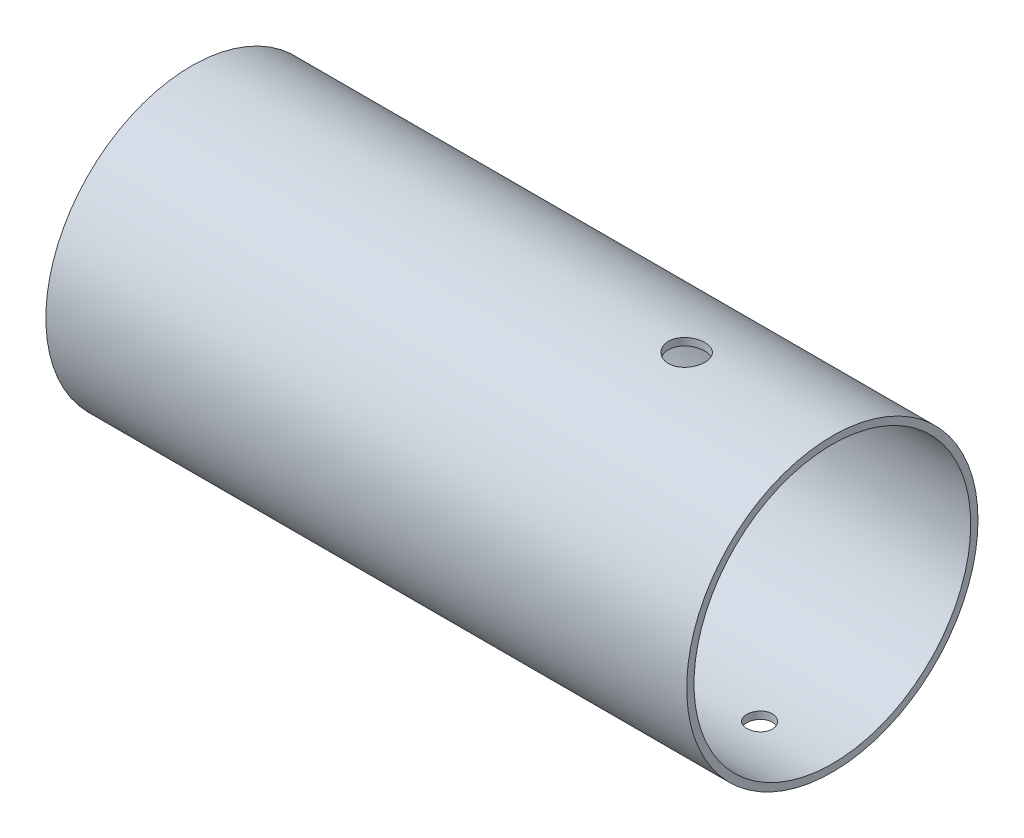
ISO-10303-21;
HEADER;
FILE_DESCRIPTION(('STEP AP214'),'2;1');
FILE_NAME('part.step','',(''),(''),'','','');
FILE_SCHEMA(('AUTOMOTIVE_DESIGN { 1 0 10303 214 1 1 1 1 }'));
ENDSEC;
DATA;
#1=APPLICATION_CONTEXT('core data for automotive mechanical design processes');
#2=APPLICATION_PROTOCOL_DEFINITION('international standard','automotive_design',2000,#1);
#3=PRODUCT_CONTEXT('',#1,'mechanical');
#4=PRODUCT('Part','Part','',(#3));
#5=PRODUCT_RELATED_PRODUCT_CATEGORY('part','',(#4));
#6=PRODUCT_DEFINITION_FORMATION('','',#4);
#7=PRODUCT_DEFINITION_CONTEXT('part definition',#1,'design');
#8=PRODUCT_DEFINITION('design','',#6,#7);
#9=PRODUCT_DEFINITION_SHAPE('','',#8);
#10=(LENGTH_UNIT() NAMED_UNIT(*) SI_UNIT(.MILLI.,.METRE.));
#11=(NAMED_UNIT(*) PLANE_ANGLE_UNIT() SI_UNIT($,.RADIAN.));
#12=(NAMED_UNIT(*) SI_UNIT($,.STERADIAN.) SOLID_ANGLE_UNIT());
#13=UNCERTAINTY_MEASURE_WITH_UNIT(LENGTH_MEASURE(1.E-05),#10,'distance_accuracy_value','');
#14=(GEOMETRIC_REPRESENTATION_CONTEXT(3) GLOBAL_UNCERTAINTY_ASSIGNED_CONTEXT((#13)) GLOBAL_UNIT_ASSIGNED_CONTEXT((#10,
#11,#12)) REPRESENTATION_CONTEXT('',''));
#15=CARTESIAN_POINT('',(0.,0.,0.));
#16=DIRECTION('',(0.,0.,1.));
#17=DIRECTION('',(1.,0.,0.));
#18=AXIS2_PLACEMENT_3D('',#15,#16,#17);
#19=CARTESIAN_POINT('',(88.,0.,0.));
#20=DIRECTION('',(-1.,0.,0.));
#21=DIRECTION('',(0.,0.,1.));
#22=AXIS2_PLACEMENT_3D('',#19,#20,#21);
#23=CYLINDRICAL_SURFACE('',#22,20.);
#24=CARTESIAN_POINT('',(0.,0.,0.));
#25=DIRECTION('',(1.,0.,0.));
#26=DIRECTION('',(0.,0.,-1.));
#27=AXIS2_PLACEMENT_3D('',#24,#25,#26);
#28=CIRCLE('',#27,20.);
#29=CARTESIAN_POINT('',(0.,0.,-20.));
#30=VERTEX_POINT('',#29);
#31=EDGE_CURVE('E40',#30,#30,#28,.T.);
#32=ORIENTED_EDGE('',*,*,#31,.T.);
#33=EDGE_LOOP('',(#32));
#34=FACE_BOUND('',#33,.T.);
#35=CARTESIAN_POINT('',(88.,0.,0.));
#36=DIRECTION('',(1.,0.,0.));
#37=DIRECTION('',(0.,0.,-1.));
#38=AXIS2_PLACEMENT_3D('',#35,#36,#37);
#39=CIRCLE('',#38,20.);
#40=CARTESIAN_POINT('',(88.,0.,-20.));
#41=VERTEX_POINT('',#40);
#42=EDGE_CURVE('E10',#41,#41,#39,.T.);
#43=ORIENTED_EDGE('',*,*,#42,.F.);
#44=EDGE_LOOP('',(#43));
#45=FACE_BOUND('',#44,.T.);
#46=CARTESIAN_POINT('',(10.,-19.9232903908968,1.75));
#47=CARTESIAN_POINT('',(10.0980961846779,-19.923291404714,1.7499957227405));
#48=CARTESIAN_POINT('',(10.1962587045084,-19.9240226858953,1.74172407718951));
#49=CARTESIAN_POINT('',(10.3898664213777,-19.9268686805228,1.7088494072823));
#50=CARTESIAN_POINT('',(10.4853084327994,-19.9289849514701,1.68422799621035));
#51=CARTESIAN_POINT('',(10.6706431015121,-19.9343594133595,1.61937247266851));
#52=CARTESIAN_POINT('',(10.7605389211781,-19.9376169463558,1.57914735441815));
#53=CARTESIAN_POINT('',(10.9322818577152,-19.9449060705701,1.48424256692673));
#54=CARTESIAN_POINT('',(11.0141306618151,-19.9489374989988,1.4295659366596));
#55=CARTESIAN_POINT('',(11.167707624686,-19.9573329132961,1.30714408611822));
#56=CARTESIAN_POINT('',(11.2394099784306,-19.9616977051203,1.23936654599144));
#57=CARTESIAN_POINT('',(11.3704368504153,-19.9702606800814,1.09273540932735));
#58=CARTESIAN_POINT('',(11.4297608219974,-19.9744588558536,1.01388132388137));
#59=CARTESIAN_POINT('',(11.5344337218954,-19.982223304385,0.847180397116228));
#60=CARTESIAN_POINT('',(11.5797601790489,-19.9857885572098,0.759319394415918));
#61=CARTESIAN_POINT('',(11.6550076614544,-19.9918767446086,0.577197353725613));
#62=CARTESIAN_POINT('',(11.684928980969,-19.9943996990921,0.482936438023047));
#63=CARTESIAN_POINT('',(11.7284421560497,-19.99811338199,0.290948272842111));
#64=CARTESIAN_POINT('',(11.7420759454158,-19.9993075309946,0.193230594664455));
#65=CARTESIAN_POINT('',(11.7527567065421,-20.00024065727,-0.0031129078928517));
#66=CARTESIAN_POINT('',(11.7498040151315,-19.9999796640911,-0.10173871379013));
#67=CARTESIAN_POINT('',(11.7274298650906,-19.9980347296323,-0.296814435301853));
#68=CARTESIAN_POINT('',(11.7080534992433,-19.9963546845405,-0.393269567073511));
#69=CARTESIAN_POINT('',(11.6534521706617,-19.9917650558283,-0.58155330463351));
#70=CARTESIAN_POINT('',(11.6182270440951,-19.9888554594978,-0.67338186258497));
#71=CARTESIAN_POINT('',(11.5328780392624,-19.9821273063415,-0.849948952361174));
#72=CARTESIAN_POINT('',(11.4827340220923,-19.9783075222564,-0.934677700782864));
#73=CARTESIAN_POINT('',(11.3689852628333,-19.9701881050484,-1.09453325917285));
#74=CARTESIAN_POINT('',(11.3053802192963,-19.9658884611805,-1.16965985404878));
#75=CARTESIAN_POINT('',(11.1662609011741,-19.9572753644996,-1.30844229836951));
#76=CARTESIAN_POINT('',(11.0907074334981,-19.9529619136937,-1.37205886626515));
#77=CARTESIAN_POINT('',(10.9299723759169,-19.9448218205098,-1.48571178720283));
#78=CARTESIAN_POINT('',(10.8447907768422,-19.9409951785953,-1.53574812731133));
#79=CARTESIAN_POINT('',(10.6671892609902,-19.9342613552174,-1.62081905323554));
#80=CARTESIAN_POINT('',(10.5747683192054,-19.9313543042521,-1.65585151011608));
#81=CARTESIAN_POINT('',(10.3853251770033,-19.9267914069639,-1.70989067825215));
#82=CARTESIAN_POINT('',(10.2883030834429,-19.9251355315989,-1.72889776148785));
#83=CARTESIAN_POINT('',(10.0927557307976,-19.9232672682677,-1.75029672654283));
#84=CARTESIAN_POINT('',(9.99423651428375,-19.9230501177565,-1.7527434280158));
#85=CARTESIAN_POINT('',(9.79818936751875,-19.9240713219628,-1.74109586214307));
#86=CARTESIAN_POINT('',(9.70066142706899,-19.9253096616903,-1.7270017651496));
#87=CARTESIAN_POINT('',(9.50952323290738,-19.9290979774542,-1.68271842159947));
#88=CARTESIAN_POINT('',(9.41590698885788,-19.9316458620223,-1.65255483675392));
#89=CARTESIAN_POINT('',(9.23506389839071,-19.9377644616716,-1.57701486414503));
#90=CARTESIAN_POINT('',(9.14783716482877,-19.9413351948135,-1.53163820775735));
#91=CARTESIAN_POINT('',(8.98199851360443,-19.9491087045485,-1.42682177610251));
#92=CARTESIAN_POINT('',(8.90340973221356,-19.9533131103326,-1.36734551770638));
#93=CARTESIAN_POINT('',(8.75731184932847,-19.961874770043,-1.23607079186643));
#94=CARTESIAN_POINT('',(8.6898029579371,-19.9662320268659,-1.16427209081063));
#95=CARTESIAN_POINT('',(8.56759361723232,-19.9746226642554,-1.01015347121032));
#96=CARTESIAN_POINT('',(8.51292881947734,-19.9786551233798,-0.927805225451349));
#97=CARTESIAN_POINT('',(8.41820418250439,-19.985928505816,-0.755065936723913));
#98=CARTESIAN_POINT('',(8.37814418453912,-19.9891694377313,-0.664674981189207));
#99=CARTESIAN_POINT('',(8.31382733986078,-19.9944903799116,-0.478543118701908));
#100=CARTESIAN_POINT('',(8.28954856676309,-19.9965720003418,-0.382809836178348));
#101=CARTESIAN_POINT('',(8.2574117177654,-19.9993463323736,-0.188606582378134));
#102=CARTESIAN_POINT('',(8.24955329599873,-20.0000390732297,-0.0901366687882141));
#103=CARTESIAN_POINT('',(8.25048444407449,-19.9999576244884,0.106393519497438));
#104=CARTESIAN_POINT('',(8.25921850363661,-19.9991883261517,0.204454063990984));
#105=CARTESIAN_POINT('',(8.29297077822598,-19.9962789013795,0.397709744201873));
#106=CARTESIAN_POINT('',(8.31798901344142,-19.9941387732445,0.492904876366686));
#107=CARTESIAN_POINT('',(8.3835850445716,-19.9887277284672,0.677730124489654));
#108=CARTESIAN_POINT('',(8.42416169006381,-19.9854568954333,0.767360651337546));
#109=CARTESIAN_POINT('',(8.51971649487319,-19.978150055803,0.938546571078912));
#110=CARTESIAN_POINT('',(8.57469446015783,-19.9741140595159,1.02010207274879));
#111=CARTESIAN_POINT('',(8.69769973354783,-19.9657135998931,1.17310714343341));
#112=CARTESIAN_POINT('',(8.76576820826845,-19.9613481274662,1.24452356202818));
#113=CARTESIAN_POINT('',(8.91294581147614,-19.9527893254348,1.37494802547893));
#114=CARTESIAN_POINT('',(8.99205760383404,-19.9485960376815,1.4339530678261));
#115=CARTESIAN_POINT('',(9.15924495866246,-19.940847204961,1.5379685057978));
#116=CARTESIAN_POINT('',(9.24733836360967,-19.9372929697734,1.58295029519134));
#117=CARTESIAN_POINT('',(9.42979951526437,-19.9312405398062,1.65742558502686));
#118=CARTESIAN_POINT('',(9.52415993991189,-19.9287411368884,1.68693681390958));
#119=CARTESIAN_POINT('',(9.68255997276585,-19.9257212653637,1.72215354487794));
#120=CARTESIAN_POINT('',(9.74558217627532,-19.9248139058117,1.7325819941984));
#121=CARTESIAN_POINT('',(9.87239356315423,-19.9235981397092,1.74650660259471));
#122=CARTESIAN_POINT('',(9.9361827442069,-19.9232897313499,1.7500027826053));
#123=CARTESIAN_POINT('',(10.,-19.9232903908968,1.75));
#124=B_SPLINE_CURVE_WITH_KNOTS('',3,(#46,#47,#48,#49,#50,#51,#52,#53,#54,#55,#56,#57,#58,#59,
#60,#61,#62,#63,#64,#65,#66,#67,#68,#69,#70,#71,#72,#73,#74,#75,#76,#77,#78,#79,#80,#81,#82,#83,
#84,#85,#86,#87,#88,#89,#90,#91,#92,#93,#94,#95,#96,#97,#98,#99,#100,#101,#102,#103,#104,#105,
#106,#107,#108,#109,#110,#111,#112,#113,#114,#115,#116,#117,#118,#119,#120,#121,#122,#123),
.UNSPECIFIED.,.T.,.F.,(4,2,2,2,2,2,2,2,2,2,2,2,2,2,2,2,2,2,2,2,2,2,2,2,2,2,2,2,2,2,2,2,2,2,2,2,
2,2,4),(0.,0.29405553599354,0.588442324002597,0.882659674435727,1.17681520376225,
1.4717058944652,1.76660960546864,2.06198431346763,2.35735337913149,2.65196033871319,
2.94656131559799,3.24035604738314,3.53415381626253,3.82834999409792,4.12255276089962,
4.41774138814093,4.71293029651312,5.00816107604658,5.30338500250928,5.59763117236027,
5.89187431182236,6.18564897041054,6.47942881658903,6.77397728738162,7.06853134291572,
7.36389358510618,7.65925261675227,7.95420039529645,8.24914196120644,8.54309853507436,
8.83705547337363,9.13099068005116,9.42492192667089,9.7197930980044,10.0147355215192,
10.3102757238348,10.6054765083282,10.7967772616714,10.9880774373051),.UNSPECIFIED.);
#125=CARTESIAN_POINT('',(10.,-19.9232903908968,1.75));
#126=VERTEX_POINT('',#125);
#127=EDGE_CURVE('E54',#126,#126,#124,.T.);
#128=ORIENTED_EDGE('',*,*,#127,.T.);
#129=EDGE_LOOP('',(#128));
#130=FACE_BOUND('',#129,.T.);
#131=CARTESIAN_POINT('',(78.,-19.9232903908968,1.75));
#132=CARTESIAN_POINT('',(78.0980961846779,-19.923291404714,1.7499957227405));
#133=CARTESIAN_POINT('',(78.1962587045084,-19.9240226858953,1.7417240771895));
#134=CARTESIAN_POINT('',(78.3898664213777,-19.9268686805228,1.70884940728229));
#135=CARTESIAN_POINT('',(78.4853084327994,-19.9289849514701,1.68422799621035));
#136=CARTESIAN_POINT('',(78.6706431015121,-19.9343594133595,1.61937247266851));
#137=CARTESIAN_POINT('',(78.7605389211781,-19.9376169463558,1.57914735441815));
#138=CARTESIAN_POINT('',(78.9322818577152,-19.9449060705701,1.48424256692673));
#139=CARTESIAN_POINT('',(79.0141306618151,-19.9489374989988,1.42956593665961));
#140=CARTESIAN_POINT('',(79.167707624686,-19.9573329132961,1.30714408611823));
#141=CARTESIAN_POINT('',(79.2394099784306,-19.9616977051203,1.23936654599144));
#142=CARTESIAN_POINT('',(79.3704368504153,-19.9702606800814,1.09273540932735));
#143=CARTESIAN_POINT('',(79.4297608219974,-19.9744588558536,1.01388132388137));
#144=CARTESIAN_POINT('',(79.5344337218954,-19.982223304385,0.847180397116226));
#145=CARTESIAN_POINT('',(79.5797601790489,-19.9857885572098,0.759319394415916));
#146=CARTESIAN_POINT('',(79.6550076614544,-19.9918767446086,0.577197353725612));
#147=CARTESIAN_POINT('',(79.684928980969,-19.9943996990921,0.482936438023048));
#148=CARTESIAN_POINT('',(79.7284421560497,-19.99811338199,0.290948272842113));
#149=CARTESIAN_POINT('',(79.7420759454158,-19.9993075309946,0.193230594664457));
#150=CARTESIAN_POINT('',(79.7527567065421,-20.00024065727,-0.00311290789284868));
#151=CARTESIAN_POINT('',(79.7498040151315,-19.9999796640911,-0.101738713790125));
#152=CARTESIAN_POINT('',(79.7274298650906,-19.9980347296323,-0.296814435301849));
#153=CARTESIAN_POINT('',(79.7080534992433,-19.9963546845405,-0.393269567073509));
#154=CARTESIAN_POINT('',(79.6534521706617,-19.9917650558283,-0.581553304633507));
#155=CARTESIAN_POINT('',(79.6182270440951,-19.9888554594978,-0.673381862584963));
#156=CARTESIAN_POINT('',(79.5328780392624,-19.9821273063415,-0.849948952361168));
#157=CARTESIAN_POINT('',(79.4827340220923,-19.9783075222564,-0.93467770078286));
#158=CARTESIAN_POINT('',(79.3689852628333,-19.9701881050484,-1.09453325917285));
#159=CARTESIAN_POINT('',(79.3053802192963,-19.9658884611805,-1.16965985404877));
#160=CARTESIAN_POINT('',(79.1662609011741,-19.9572753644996,-1.30844229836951));
#161=CARTESIAN_POINT('',(79.0907074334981,-19.9529619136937,-1.37205886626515));
#162=CARTESIAN_POINT('',(78.9299723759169,-19.9448218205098,-1.48571178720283));
#163=CARTESIAN_POINT('',(78.8447907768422,-19.9409951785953,-1.53574812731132));
#164=CARTESIAN_POINT('',(78.6671892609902,-19.9342613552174,-1.62081905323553));
#165=CARTESIAN_POINT('',(78.5747683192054,-19.9313543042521,-1.65585151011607));
#166=CARTESIAN_POINT('',(78.3853251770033,-19.9267914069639,-1.70989067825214));
#167=CARTESIAN_POINT('',(78.2883030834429,-19.9251355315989,-1.72889776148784));
#168=CARTESIAN_POINT('',(78.0927557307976,-19.9232672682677,-1.75029672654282));
#169=CARTESIAN_POINT('',(77.9942365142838,-19.9230501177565,-1.75274342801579));
#170=CARTESIAN_POINT('',(77.7981893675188,-19.9240713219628,-1.74109586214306));
#171=CARTESIAN_POINT('',(77.700661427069,-19.9253096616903,-1.7270017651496));
#172=CARTESIAN_POINT('',(77.5095232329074,-19.9290979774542,-1.68271842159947));
#173=CARTESIAN_POINT('',(77.4159069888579,-19.9316458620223,-1.65255483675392));
#174=CARTESIAN_POINT('',(77.2350638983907,-19.9377644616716,-1.57701486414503));
#175=CARTESIAN_POINT('',(77.1478371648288,-19.9413351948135,-1.53163820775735));
#176=CARTESIAN_POINT('',(76.9819985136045,-19.9491087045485,-1.42682177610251));
#177=CARTESIAN_POINT('',(76.9034097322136,-19.9533131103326,-1.36734551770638));
#178=CARTESIAN_POINT('',(76.7573118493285,-19.961874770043,-1.23607079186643));
#179=CARTESIAN_POINT('',(76.6898029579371,-19.9662320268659,-1.16427209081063));
#180=CARTESIAN_POINT('',(76.5675936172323,-19.9746226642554,-1.01015347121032));
#181=CARTESIAN_POINT('',(76.5129288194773,-19.9786551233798,-0.927805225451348));
#182=CARTESIAN_POINT('',(76.4182041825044,-19.985928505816,-0.755065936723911));
#183=CARTESIAN_POINT('',(76.3781441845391,-19.9891694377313,-0.664674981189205));
#184=CARTESIAN_POINT('',(76.3138273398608,-19.9944903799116,-0.478543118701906));
#185=CARTESIAN_POINT('',(76.2895485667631,-19.9965720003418,-0.382809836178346));
#186=CARTESIAN_POINT('',(76.2574117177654,-19.9993463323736,-0.188606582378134));
#187=CARTESIAN_POINT('',(76.2495532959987,-20.0000390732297,-0.090136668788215));
#188=CARTESIAN_POINT('',(76.2504844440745,-19.9999576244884,0.106393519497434));
#189=CARTESIAN_POINT('',(76.2592185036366,-19.9991883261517,0.20445406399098));
#190=CARTESIAN_POINT('',(76.292970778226,-19.9962789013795,0.397709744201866));
#191=CARTESIAN_POINT('',(76.3179890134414,-19.9941387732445,0.49290487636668));
#192=CARTESIAN_POINT('',(76.3835850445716,-19.9887277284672,0.677730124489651));
#193=CARTESIAN_POINT('',(76.4241616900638,-19.9854568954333,0.767360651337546));
#194=CARTESIAN_POINT('',(76.5197164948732,-19.978150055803,0.938546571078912));
#195=CARTESIAN_POINT('',(76.5746944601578,-19.9741140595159,1.02010207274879));
#196=CARTESIAN_POINT('',(76.6976997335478,-19.9657135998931,1.1731071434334));
#197=CARTESIAN_POINT('',(76.7657682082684,-19.9613481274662,1.24452356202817));
#198=CARTESIAN_POINT('',(76.9129458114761,-19.9527893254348,1.37494802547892));
#199=CARTESIAN_POINT('',(76.992057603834,-19.9485960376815,1.43395306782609));
#200=CARTESIAN_POINT('',(77.1592449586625,-19.940847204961,1.5379685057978));
#201=CARTESIAN_POINT('',(77.2473383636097,-19.9372929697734,1.58295029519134));
#202=CARTESIAN_POINT('',(77.4297995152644,-19.9312405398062,1.65742558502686));
#203=CARTESIAN_POINT('',(77.5241599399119,-19.9287411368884,1.68693681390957));
#204=CARTESIAN_POINT('',(77.6825599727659,-19.9257212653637,1.72215354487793));
#205=CARTESIAN_POINT('',(77.7455821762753,-19.9248139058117,1.73258199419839));
#206=CARTESIAN_POINT('',(77.8723935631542,-19.9235981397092,1.7465066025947));
#207=CARTESIAN_POINT('',(77.9361827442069,-19.9232897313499,1.7500027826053));
#208=CARTESIAN_POINT('',(78.,-19.9232903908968,1.75));
#209=B_SPLINE_CURVE_WITH_KNOTS('',3,(#131,#132,#133,#134,#135,#136,#137,#138,#139,#140,#141,
#142,#143,#144,#145,#146,#147,#148,#149,#150,#151,#152,#153,#154,#155,#156,#157,#158,#159,#160,
#161,#162,#163,#164,#165,#166,#167,#168,#169,#170,#171,#172,#173,#174,#175,#176,#177,#178,#179,
#180,#181,#182,#183,#184,#185,#186,#187,#188,#189,#190,#191,#192,#193,#194,#195,#196,#197,#198,
#199,#200,#201,#202,#203,#204,#205,#206,#207,#208),.UNSPECIFIED.,.T.,.F.,(4,2,2,2,2,2,2,2,2,2,2,
2,2,2,2,2,2,2,2,2,2,2,2,2,2,2,2,2,2,2,2,2,2,2,2,2,2,2,4),(0.,0.29405553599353,0.588442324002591,
0.882659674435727,1.17681520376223,1.47170589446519,1.76660960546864,2.06198431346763,
2.35735337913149,2.65196033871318,2.94656131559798,3.24035604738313,3.53415381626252,
3.82834999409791,4.12255276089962,4.41774138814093,4.7129302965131,5.00816107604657,
5.30338500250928,5.59763117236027,5.89187431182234,6.18564897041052,6.47942881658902,
6.7739772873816,7.06853134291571,7.36389358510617,7.65925261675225,7.95420039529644,
8.24914196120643,8.54309853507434,8.83705547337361,9.13099068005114,9.42492192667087,
9.71979309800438,10.0147355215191,10.3102757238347,10.6054765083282,10.7967772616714,
10.988077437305),.UNSPECIFIED.);
#210=CARTESIAN_POINT('',(78.,-19.9232903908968,1.75));
#211=VERTEX_POINT('',#210);
#212=EDGE_CURVE('E55',#211,#211,#209,.T.);
#213=ORIENTED_EDGE('',*,*,#212,.T.);
#214=EDGE_LOOP('',(#213));
#215=FACE_BOUND('',#214,.T.);
#216=CARTESIAN_POINT('',(68.,19.8431348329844,-2.5));
#217=CARTESIAN_POINT('',(67.8601637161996,19.8431368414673,-2.49999405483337));
#218=CARTESIAN_POINT('',(67.7202400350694,19.8446289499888,-2.48822789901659));
#219=CARTESIAN_POINT('',(67.4442867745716,19.8504339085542,-2.44147641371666));
#220=CARTESIAN_POINT('',(67.3082614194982,19.8547497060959,-2.4064668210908));
#221=CARTESIAN_POINT('',(67.0441401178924,19.8657057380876,-2.31427669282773));
#222=CARTESIAN_POINT('',(66.9160388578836,19.8723443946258,-2.25711120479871));
#223=CARTESIAN_POINT('',(66.6712715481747,19.8871962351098,-2.12226419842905));
#224=CARTESIAN_POINT('',(66.5546035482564,19.8954091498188,-2.04458618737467));
#225=CARTESIAN_POINT('',(66.3353377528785,19.9125355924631,-1.87045345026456));
#226=CARTESIAN_POINT('',(66.2328131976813,19.9214524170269,-1.77390681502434));
#227=CARTESIAN_POINT('',(66.0453772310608,19.9389523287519,-1.5649752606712));
#228=CARTESIAN_POINT('',(65.9604666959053,19.9475353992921,-1.45258955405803));
#229=CARTESIAN_POINT('',(65.8104064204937,19.96343444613,-1.21470983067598));
#230=CARTESIAN_POINT('',(65.7453229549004,19.9707461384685,-1.08917369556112));
#231=CARTESIAN_POINT('',(65.637188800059,19.9832423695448,-0.828846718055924));
#232=CARTESIAN_POINT('',(65.5941372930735,19.9884269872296,-0.694056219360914));
#233=CARTESIAN_POINT('',(65.5315079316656,19.9960616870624,-0.419795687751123));
#234=CARTESIAN_POINT('',(65.5118083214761,19.9985259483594,-0.280353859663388));
#235=CARTESIAN_POINT('',(65.4960646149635,20.0004906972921,-0.000123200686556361));
#236=CARTESIAN_POINT('',(65.5000195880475,19.9999913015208,0.140665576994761));
#237=CARTESIAN_POINT('',(65.5313752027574,19.9960964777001,0.418765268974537));
#238=CARTESIAN_POINT('',(65.5586448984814,19.9927172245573,0.556091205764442));
#239=CARTESIAN_POINT('',(65.6356511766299,19.9834605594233,0.824202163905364));
#240=CARTESIAN_POINT('',(65.6853881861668,19.9775830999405,0.954987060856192));
#241=CARTESIAN_POINT('',(65.8060564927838,19.9639625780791,1.20670881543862));
#242=CARTESIAN_POINT('',(65.8770444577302,19.9562145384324,1.3276182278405));
#243=CARTESIAN_POINT('',(66.038158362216,19.9397196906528,1.55585745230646));
#244=CARTESIAN_POINT('',(66.1282851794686,19.9309728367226,1.66318664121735));
#245=CARTESIAN_POINT('',(66.3258518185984,19.9133886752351,1.86198803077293));
#246=CARTESIAN_POINT('',(66.4334057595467,19.9045511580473,1.95334683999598));
#247=CARTESIAN_POINT('',(66.6623815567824,19.8878407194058,2.11673285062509));
#248=CARTESIAN_POINT('',(66.7838034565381,19.8799678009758,2.18875999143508));
#249=CARTESIAN_POINT('',(67.0371694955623,19.8660780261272,2.31144457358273));
#250=CARTESIAN_POINT('',(67.1691180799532,19.8600619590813,2.36209292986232));
#251=CARTESIAN_POINT('',(67.4397394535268,19.8505824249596,2.44048165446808));
#252=CARTESIAN_POINT('',(67.5784119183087,19.847118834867,2.46822312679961));
#253=CARTESIAN_POINT('',(67.8575431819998,19.8431588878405,2.49986043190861));
#254=CARTESIAN_POINT('',(67.9979836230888,19.8426426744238,2.50391584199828));
#255=CARTESIAN_POINT('',(68.2775419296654,19.8445834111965,2.48848695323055));
#256=CARTESIAN_POINT('',(68.4166598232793,19.8470402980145,2.4690031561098));
#257=CARTESIAN_POINT('',(68.6891457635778,19.8546322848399,2.40718328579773));
#258=CARTESIAN_POINT('',(68.8225316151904,19.8597583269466,2.36492448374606));
#259=CARTESIAN_POINT('',(69.0803241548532,19.8721036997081,2.25883371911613));
#260=CARTESIAN_POINT('',(69.2047305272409,19.8793231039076,2.19500099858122));
#261=CARTESIAN_POINT('',(69.441754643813,19.8950893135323,2.04718202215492));
#262=CARTESIAN_POINT('',(69.5543066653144,19.9036429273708,1.9630911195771));
#263=CARTESIAN_POINT('',(69.763756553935,19.9210923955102,1.77729074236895));
#264=CARTESIAN_POINT('',(69.860653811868,19.9299882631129,1.67558058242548));
#265=CARTESIAN_POINT('',(70.0366041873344,19.9471808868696,1.45673177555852));
#266=CARTESIAN_POINT('',(70.115552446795,19.9554739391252,1.33950849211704));
#267=CARTESIAN_POINT('',(70.2526382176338,19.9704711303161,1.09337258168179));
#268=CARTESIAN_POINT('',(70.310776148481,19.9771753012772,0.964460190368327));
#269=CARTESIAN_POINT('',(70.404417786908,19.9882229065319,0.698953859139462));
#270=CARTESIAN_POINT('',(70.4399820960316,19.992572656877,0.562381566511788));
#271=CARTESIAN_POINT('',(70.4876640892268,19.9984475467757,0.285146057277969));
#272=CARTESIAN_POINT('',(70.4997828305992,19.9999728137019,0.144483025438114));
#273=CARTESIAN_POINT('',(70.5002099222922,20.0000262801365,-0.135917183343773));
#274=CARTESIAN_POINT('',(70.488679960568,19.998574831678,-0.275654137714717));
#275=CARTESIAN_POINT('',(70.4424793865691,19.9928784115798,-0.551187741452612));
#276=CARTESIAN_POINT('',(70.4078087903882,19.9886334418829,-0.686984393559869));
#277=CARTESIAN_POINT('',(70.3163618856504,19.9778248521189,-0.950761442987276));
#278=CARTESIAN_POINT('',(70.259593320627,19.9712620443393,-1.07874456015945));
#279=CARTESIAN_POINT('',(70.1255786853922,19.9565444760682,-1.32339333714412));
#280=CARTESIAN_POINT('',(70.0483323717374,19.9483896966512,-1.44005886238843));
#281=CARTESIAN_POINT('',(69.8749567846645,19.9313319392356,-1.65958676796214));
#282=CARTESIAN_POINT('',(69.7787072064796,19.9224244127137,-1.76235378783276));
#283=CARTESIAN_POINT('',(69.5703070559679,19.9049015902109,-1.95034111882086));
#284=CARTESIAN_POINT('',(69.4581527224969,19.8962863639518,-2.03555726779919));
#285=CARTESIAN_POINT('',(69.220630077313,19.8802881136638,-2.18630524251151));
#286=CARTESIAN_POINT('',(69.0952124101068,19.8729099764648,-2.2517597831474));
#287=CARTESIAN_POINT('',(68.8351432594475,19.8602785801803,-2.36058528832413));
#288=CARTESIAN_POINT('',(68.7005020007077,19.8550230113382,-2.40398027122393));
#289=CARTESIAN_POINT('',(68.4709700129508,19.8485078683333,-2.4570658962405));
#290=CARTESIAN_POINT('',(68.3775270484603,19.8465030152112,-2.47314303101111));
#291=CARTESIAN_POINT('',(68.1894027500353,19.8438158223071,-2.49461205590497));
#292=CARTESIAN_POINT('',(68.0947214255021,19.8431334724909,-2.5000040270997));
#293=CARTESIAN_POINT('',(68.,19.8431348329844,-2.5));
#294=B_SPLINE_CURVE_WITH_KNOTS('',3,(#216,#217,#218,#219,#220,#221,#222,#223,#224,#225,#226,
#227,#228,#229,#230,#231,#232,#233,#234,#235,#236,#237,#238,#239,#240,#241,#242,#243,#244,#245,
#246,#247,#248,#249,#250,#251,#252,#253,#254,#255,#256,#257,#258,#259,#260,#261,#262,#263,#264,
#265,#266,#267,#268,#269,#270,#271,#272,#273,#274,#275,#276,#277,#278,#279,#280,#281,#282,#283,
#284,#285,#286,#287,#288,#289,#290,#291,#292,#293),.UNSPECIFIED.,.T.,.F.,(4,2,2,2,2,2,2,2,2,2,2,
2,2,2,2,2,2,2,2,2,2,2,2,2,2,2,2,2,2,2,2,2,2,2,2,2,2,2,4),(0.,0.419162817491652,
0.838763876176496,1.25808045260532,1.67732537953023,2.09866577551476,2.52002712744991,
2.94278186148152,3.36552090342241,3.78604596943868,4.20655449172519,4.62471664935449,
5.042886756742,5.46218204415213,5.88149656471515,6.3036769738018,6.72585870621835,
7.14821966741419,7.57056027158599,7.99005217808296,8.40953514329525,8.82760376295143,
9.24568707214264,9.66597819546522,10.0862856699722,10.5089888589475,10.9316835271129,
11.3532385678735,11.7747745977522,12.1934381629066,12.612101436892,13.030618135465,
13.4491398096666,13.8704012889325,14.2917625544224,14.7147509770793,15.1372778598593,
15.4212098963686,15.7051397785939),.UNSPECIFIED.);
#295=CARTESIAN_POINT('',(68.,19.8431348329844,-2.5));
#296=VERTEX_POINT('',#295);
#297=EDGE_CURVE('E109',#296,#296,#294,.T.);
#298=ORIENTED_EDGE('',*,*,#297,.F.);
#299=EDGE_LOOP('',(#298));
#300=FACE_BOUND('',#299,.T.);
#301=ADVANCED_FACE('F28',(#34,#45,#130,#215,#300),#23,.T.);
#302=CARTESIAN_POINT('',(88.,0.,0.));
#303=DIRECTION('',(-1.,0.,0.));
#304=DIRECTION('',(0.,0.,1.));
#305=AXIS2_PLACEMENT_3D('',#302,#303,#304);
#306=CYLINDRICAL_SURFACE('',#305,19.);
#307=CARTESIAN_POINT('',(0.,0.,0.));
#308=DIRECTION('',(1.,0.,0.));
#309=DIRECTION('',(0.,0.,-1.));
#310=AXIS2_PLACEMENT_3D('',#307,#308,#309);
#311=CIRCLE('',#310,19.);
#312=CARTESIAN_POINT('',(0.,0.,-19.));
#313=VERTEX_POINT('',#312);
#314=EDGE_CURVE('E77',#313,#313,#311,.T.);
#315=ORIENTED_EDGE('',*,*,#314,.F.);
#316=EDGE_LOOP('',(#315));
#317=FACE_BOUND('',#316,.T.);
#318=CARTESIAN_POINT('',(88.,0.,0.));
#319=DIRECTION('',(1.,0.,0.));
#320=DIRECTION('',(0.,0.,-1.));
#321=AXIS2_PLACEMENT_3D('',#318,#319,#320);
#322=CIRCLE('',#321,19.);
#323=CARTESIAN_POINT('',(88.,0.,-19.));
#324=VERTEX_POINT('',#323);
#325=EDGE_CURVE('E45',#324,#324,#322,.T.);
#326=ORIENTED_EDGE('',*,*,#325,.T.);
#327=EDGE_LOOP('',(#326));
#328=FACE_BOUND('',#327,.T.);
#329=CARTESIAN_POINT('',(10.,-18.9192362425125,1.75));
#330=CARTESIAN_POINT('',(10.0980743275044,-18.9192373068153,1.749995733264));
#331=CARTESIAN_POINT('',(10.1962144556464,-18.920007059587,1.74172775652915));
#332=CARTESIAN_POINT('',(10.3897765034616,-18.9230026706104,1.70886851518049));
#333=CARTESIAN_POINT('',(10.4851952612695,-18.925230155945,1.68425901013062));
#334=CARTESIAN_POINT('',(10.6704832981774,-18.9308868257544,1.61943696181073));
#335=CARTESIAN_POINT('',(10.7603557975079,-18.9343153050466,1.57923357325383));
#336=CARTESIAN_POINT('',(10.9320566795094,-18.9419867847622,1.48438193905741));
#337=CARTESIAN_POINT('',(11.0138867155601,-18.946229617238,1.42973667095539));
#338=CARTESIAN_POINT('',(11.1674543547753,-18.9550665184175,1.30736968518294));
#339=CARTESIAN_POINT('',(11.2391634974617,-18.9596615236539,1.23961231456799));
#340=CARTESIAN_POINT('',(11.3702089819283,-18.9686764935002,1.09302037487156));
#341=CARTESIAN_POINT('',(11.4295447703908,-18.973096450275,1.01418531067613));
#342=CARTESIAN_POINT('',(11.5342559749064,-18.9812723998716,0.847503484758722));
#343=CARTESIAN_POINT('',(11.5796064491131,-18.9850272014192,0.759640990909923));
#344=CARTESIAN_POINT('',(11.6549001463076,-18.9914396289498,0.577507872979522));
#345=CARTESIAN_POINT('',(11.684843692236,-18.9940972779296,0.48323738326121));
#346=CARTESIAN_POINT('',(11.7283907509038,-18.9980093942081,0.291250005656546));
#347=CARTESIAN_POINT('',(11.7420407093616,-18.9992678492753,0.193543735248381));
#348=CARTESIAN_POINT('',(11.7527567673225,-19.0002533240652,-0.00278053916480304));
#349=CARTESIAN_POINT('',(11.7498232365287,-18.9999803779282,-0.101398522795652));
#350=CARTESIAN_POINT('',(11.7274934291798,-18.9979370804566,-0.296431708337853));
#351=CARTESIAN_POINT('',(11.7081470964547,-18.996171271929,-0.392852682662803));
#352=CARTESIAN_POINT('',(11.6536185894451,-18.9913460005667,-0.581073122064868));
#353=CARTESIAN_POINT('',(11.6184362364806,-18.9882865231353,-0.67287253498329));
#354=CARTESIAN_POINT('',(11.5331791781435,-18.9812101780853,-0.849402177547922));
#355=CARTESIAN_POINT('',(11.4830822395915,-18.9771918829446,-0.934121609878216));
#356=CARTESIAN_POINT('',(11.3694342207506,-18.9686491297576,-1.09396858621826));
#357=CARTESIAN_POINT('',(11.3058828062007,-18.9641246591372,-1.16909589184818));
#358=CARTESIAN_POINT('',(11.1668486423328,-18.9550578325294,-1.30791830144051));
#359=CARTESIAN_POINT('',(11.0913224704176,-18.9505154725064,-1.3715699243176));
#360=CARTESIAN_POINT('',(10.9306336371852,-18.9419416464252,-1.48529785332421));
#361=CARTESIAN_POINT('',(10.8454709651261,-18.9379101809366,-1.53537414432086));
#362=CARTESIAN_POINT('',(10.6678946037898,-18.9308140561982,-1.62052899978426));
#363=CARTESIAN_POINT('',(10.5754797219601,-18.9277495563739,-1.65560509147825));
#364=CARTESIAN_POINT('',(10.386037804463,-18.9229375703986,-1.70973055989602));
#365=CARTESIAN_POINT('',(10.2890108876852,-18.9211900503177,-1.72878034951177));
#366=CARTESIAN_POINT('',(10.0934802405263,-18.9192155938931,-1.75025696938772));
#367=CARTESIAN_POINT('',(9.99498323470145,-18.9189831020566,-1.75274453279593));
#368=CARTESIAN_POINT('',(9.79897370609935,-18.9200503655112,-1.74118538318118));
#369=CARTESIAN_POINT('',(9.70146117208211,-18.9213501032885,-1.72713885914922));
#370=CARTESIAN_POINT('',(9.51036431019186,-18.925330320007,-1.68296098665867));
#371=CARTESIAN_POINT('',(9.41677333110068,-18.9280083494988,-1.65285816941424));
#372=CARTESIAN_POINT('',(9.23596989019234,-18.9344413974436,-1.57745128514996));
#373=CARTESIAN_POINT('',(9.14875755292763,-18.9381964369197,-1.53214692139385));
#374=CARTESIAN_POINT('',(8.98290966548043,-18.9463738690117,-1.4274700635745));
#375=CARTESIAN_POINT('',(8.90429968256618,-18.9507981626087,-1.36805721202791));
#376=CARTESIAN_POINT('',(8.75814679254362,-18.9598092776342,-1.23690795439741));
#377=CARTESIAN_POINT('',(8.69060411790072,-18.9643961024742,-1.16517128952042));
#378=CARTESIAN_POINT('',(8.56829475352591,-18.9732321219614,-1.01114777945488));
#379=CARTESIAN_POINT('',(8.51356760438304,-18.9774802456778,-0.92882946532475));
#380=CARTESIAN_POINT('',(8.41871449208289,-18.9851447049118,-0.756135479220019));
#381=CARTESIAN_POINT('',(8.37858835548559,-18.9885610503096,-0.665759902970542));
#382=CARTESIAN_POINT('',(8.31414375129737,-18.9941721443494,-0.479656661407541));
#383=CARTESIAN_POINT('',(8.28980111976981,-18.9963687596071,-0.383937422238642));
#384=CARTESIAN_POINT('',(8.25753560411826,-18.9993005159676,-0.189749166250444));
#385=CARTESIAN_POINT('',(8.249612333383,-19.0000356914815,-0.0912802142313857));
#386=CARTESIAN_POINT('',(8.25041542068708,-18.9999617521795,0.105223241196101));
#387=CARTESIAN_POINT('',(8.25908027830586,-18.9991583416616,0.20325800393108));
#388=CARTESIAN_POINT('',(8.29268504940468,-18.9961087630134,0.396473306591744));
#389=CARTESIAN_POINT('',(8.31762498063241,-18.9938625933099,0.491653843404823));
#390=CARTESIAN_POINT('',(8.38305558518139,-18.9881793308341,0.676460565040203));
#391=CARTESIAN_POINT('',(8.42354479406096,-18.9847423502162,0.766087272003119));
#392=CARTESIAN_POINT('',(8.51891786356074,-18.9770612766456,0.93728156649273));
#393=CARTESIAN_POINT('',(8.57380156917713,-18.9728171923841,1.01884924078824));
#394=CARTESIAN_POINT('',(8.69663661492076,-18.9639790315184,1.17192514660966));
#395=CARTESIAN_POINT('',(8.76463364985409,-18.9593837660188,1.24339664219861));
#396=CARTESIAN_POINT('',(8.9116780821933,-18.9503712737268,1.37394415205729));
#397=CARTESIAN_POINT('',(8.99072813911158,-18.9459540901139,1.43301717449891));
#398=CARTESIAN_POINT('',(9.15782123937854,-18.9377874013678,1.5371900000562));
#399=CARTESIAN_POINT('',(9.24588374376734,-18.9340393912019,1.5822586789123));
#400=CARTESIAN_POINT('',(9.42830272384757,-18.9276534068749,1.6569107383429));
#401=CARTESIAN_POINT('',(9.52265189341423,-18.9250141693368,1.68651175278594));
#402=CARTESIAN_POINT('',(9.68128882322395,-18.9218166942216,1.7219282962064));
#403=CARTESIAN_POINT('',(9.7445592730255,-18.9208535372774,1.73244099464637));
#404=CARTESIAN_POINT('',(9.87187712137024,-18.9195629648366,1.74647822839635));
#405=CARTESIAN_POINT('',(9.93592451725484,-18.9192355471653,1.75000278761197));
#406=CARTESIAN_POINT('',(10.,-18.9192362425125,1.75));
#407=B_SPLINE_CURVE_WITH_KNOTS('',3,(#329,#330,#331,#332,#333,#334,#335,#336,#337,#338,#339,
#340,#341,#342,#343,#344,#345,#346,#347,#348,#349,#350,#351,#352,#353,#354,#355,#356,#357,#358,
#359,#360,#361,#362,#363,#364,#365,#366,#367,#368,#369,#370,#371,#372,#373,#374,#375,#376,#377,
#378,#379,#380,#381,#382,#383,#384,#385,#386,#387,#388,#389,#390,#391,#392,#393,#394,#395,#396,
#397,#398,#399,#400,#401,#402,#403,#404,#405,#406),.UNSPECIFIED.,.T.,.F.,(4,2,2,2,2,2,2,2,2,2,2,
2,2,2,2,2,2,2,2,2,2,2,2,2,2,2,2,2,2,2,2,2,2,2,2,2,2,2,4),(0.,0.29398901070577,0.588306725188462,
0.882451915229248,1.17653650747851,1.47143227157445,1.76634122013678,2.06177311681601,
2.35719882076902,2.65178037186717,2.94635535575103,3.24003715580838,3.53372226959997,
3.82784739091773,4.12197982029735,4.41720430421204,4.71242911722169,5.00770257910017,
5.30296843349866,5.59715095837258,5.89133012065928,6.18498827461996,6.47865216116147,
6.77316641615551,7.06768685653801,7.36310436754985,7.65851836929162,7.95347902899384,
8.24843274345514,8.54229503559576,8.83615764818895,9.12999259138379,9.42382437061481,
9.71869916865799,10.0136450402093,10.3092418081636,10.6045008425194,10.7965750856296,
10.9886486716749),.UNSPECIFIED.);
#408=CARTESIAN_POINT('',(10.,-18.9192362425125,1.75));
#409=VERTEX_POINT('',#408);
#410=EDGE_CURVE('E49',#409,#409,#407,.T.);
#411=ORIENTED_EDGE('',*,*,#410,.F.);
#412=EDGE_LOOP('',(#411));
#413=FACE_BOUND('',#412,.T.);
#414=CARTESIAN_POINT('',(78.,-18.9192362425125,1.75));
#415=CARTESIAN_POINT('',(78.0980743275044,-18.9192373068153,1.749995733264));
#416=CARTESIAN_POINT('',(78.1962144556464,-18.920007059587,1.74172775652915));
#417=CARTESIAN_POINT('',(78.3897765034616,-18.9230026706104,1.70886851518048));
#418=CARTESIAN_POINT('',(78.4851952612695,-18.925230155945,1.68425901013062));
#419=CARTESIAN_POINT('',(78.6704832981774,-18.9308868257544,1.61943696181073));
#420=CARTESIAN_POINT('',(78.7603557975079,-18.9343153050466,1.57923357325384));
#421=CARTESIAN_POINT('',(78.9320566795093,-18.9419867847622,1.48438193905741));
#422=CARTESIAN_POINT('',(79.01388671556,-18.946229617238,1.42973667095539));
#423=CARTESIAN_POINT('',(79.1674543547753,-18.9550665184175,1.30736968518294));
#424=CARTESIAN_POINT('',(79.2391634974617,-18.9596615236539,1.239612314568));
#425=CARTESIAN_POINT('',(79.3702089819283,-18.9686764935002,1.09302037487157));
#426=CARTESIAN_POINT('',(79.4295447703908,-18.973096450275,1.01418531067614));
#427=CARTESIAN_POINT('',(79.5342559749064,-18.9812723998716,0.847503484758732));
#428=CARTESIAN_POINT('',(79.5796064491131,-18.9850272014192,0.759640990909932));
#429=CARTESIAN_POINT('',(79.6549001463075,-18.9914396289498,0.577507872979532));
#430=CARTESIAN_POINT('',(79.684843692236,-18.9940972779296,0.483237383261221));
#431=CARTESIAN_POINT('',(79.7283907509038,-18.9980093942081,0.291250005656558));
#432=CARTESIAN_POINT('',(79.7420407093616,-18.9992678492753,0.193543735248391));
#433=CARTESIAN_POINT('',(79.7527567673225,-19.0002533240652,-0.00278053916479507));
#434=CARTESIAN_POINT('',(79.7498232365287,-18.9999803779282,-0.101398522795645));
#435=CARTESIAN_POINT('',(79.7274934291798,-18.9979370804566,-0.296431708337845));
#436=CARTESIAN_POINT('',(79.7081470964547,-18.996171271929,-0.392852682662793));
#437=CARTESIAN_POINT('',(79.6536185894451,-18.9913460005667,-0.581073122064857));
#438=CARTESIAN_POINT('',(79.6184362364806,-18.9882865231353,-0.67287253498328));
#439=CARTESIAN_POINT('',(79.5331791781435,-18.9812101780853,-0.849402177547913));
#440=CARTESIAN_POINT('',(79.4830822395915,-18.9771918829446,-0.934121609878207));
#441=CARTESIAN_POINT('',(79.3694342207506,-18.9686491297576,-1.09396858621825));
#442=CARTESIAN_POINT('',(79.3058828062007,-18.9641246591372,-1.16909589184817));
#443=CARTESIAN_POINT('',(79.1668486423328,-18.9550578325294,-1.3079183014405));
#444=CARTESIAN_POINT('',(79.0913224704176,-18.9505154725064,-1.37156992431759));
#445=CARTESIAN_POINT('',(78.9306336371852,-18.9419416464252,-1.4852978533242));
#446=CARTESIAN_POINT('',(78.8454709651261,-18.9379101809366,-1.53537414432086));
#447=CARTESIAN_POINT('',(78.6678946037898,-18.9308140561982,-1.62052899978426));
#448=CARTESIAN_POINT('',(78.5754797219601,-18.9277495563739,-1.65560509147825));
#449=CARTESIAN_POINT('',(78.386037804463,-18.9229375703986,-1.70973055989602));
#450=CARTESIAN_POINT('',(78.2890108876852,-18.9211900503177,-1.72878034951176));
#451=CARTESIAN_POINT('',(78.0934802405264,-18.9192155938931,-1.75025696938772));
#452=CARTESIAN_POINT('',(77.9949832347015,-18.9189831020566,-1.75274453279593));
#453=CARTESIAN_POINT('',(77.7989737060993,-18.9200503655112,-1.74118538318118));
#454=CARTESIAN_POINT('',(77.7014611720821,-18.9213501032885,-1.72713885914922));
#455=CARTESIAN_POINT('',(77.5103643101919,-18.925330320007,-1.68296098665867));
#456=CARTESIAN_POINT('',(77.4167733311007,-18.9280083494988,-1.65285816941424));
#457=CARTESIAN_POINT('',(77.2359698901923,-18.9344413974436,-1.57745128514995));
#458=CARTESIAN_POINT('',(77.1487575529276,-18.9381964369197,-1.53214692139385));
#459=CARTESIAN_POINT('',(76.9829096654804,-18.9463738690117,-1.4274700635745));
#460=CARTESIAN_POINT('',(76.9042996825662,-18.9507981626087,-1.36805721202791));
#461=CARTESIAN_POINT('',(76.7581467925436,-18.9598092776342,-1.23690795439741));
#462=CARTESIAN_POINT('',(76.6906041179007,-18.9643961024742,-1.16517128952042));
#463=CARTESIAN_POINT('',(76.5682947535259,-18.9732321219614,-1.01114777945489));
#464=CARTESIAN_POINT('',(76.513567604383,-18.9774802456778,-0.928829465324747));
#465=CARTESIAN_POINT('',(76.4187144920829,-18.9851447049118,-0.756135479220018));
#466=CARTESIAN_POINT('',(76.3785883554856,-18.9885610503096,-0.665759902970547));
#467=CARTESIAN_POINT('',(76.3141437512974,-18.9941721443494,-0.47965666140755));
#468=CARTESIAN_POINT('',(76.2898011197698,-18.9963687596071,-0.383937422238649));
#469=CARTESIAN_POINT('',(76.2575356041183,-18.9993005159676,-0.18974916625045));
#470=CARTESIAN_POINT('',(76.249612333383,-19.0000356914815,-0.0912802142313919));
#471=CARTESIAN_POINT('',(76.2504154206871,-18.9999617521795,0.105223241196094));
#472=CARTESIAN_POINT('',(76.2590802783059,-18.9991583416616,0.203258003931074));
#473=CARTESIAN_POINT('',(76.2926850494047,-18.9961087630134,0.396473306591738));
#474=CARTESIAN_POINT('',(76.3176249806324,-18.9938625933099,0.491653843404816));
#475=CARTESIAN_POINT('',(76.3830555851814,-18.9881793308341,0.676460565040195));
#476=CARTESIAN_POINT('',(76.423544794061,-18.9847423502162,0.766087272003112));
#477=CARTESIAN_POINT('',(76.5189178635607,-18.9770612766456,0.937281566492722));
#478=CARTESIAN_POINT('',(76.5738015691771,-18.9728171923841,1.01884924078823));
#479=CARTESIAN_POINT('',(76.6966366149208,-18.9639790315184,1.17192514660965));
#480=CARTESIAN_POINT('',(76.7646336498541,-18.9593837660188,1.2433966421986));
#481=CARTESIAN_POINT('',(76.9116780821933,-18.9503712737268,1.37394415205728));
#482=CARTESIAN_POINT('',(76.9907281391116,-18.9459540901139,1.4330171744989));
#483=CARTESIAN_POINT('',(77.1578212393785,-18.9377874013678,1.53719000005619));
#484=CARTESIAN_POINT('',(77.2458837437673,-18.9340393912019,1.58225867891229));
#485=CARTESIAN_POINT('',(77.4283027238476,-18.9276534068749,1.65691073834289));
#486=CARTESIAN_POINT('',(77.5226518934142,-18.9250141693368,1.68651175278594));
#487=CARTESIAN_POINT('',(77.6812888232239,-18.9218166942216,1.72192829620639));
#488=CARTESIAN_POINT('',(77.7445592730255,-18.9208535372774,1.73244099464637));
#489=CARTESIAN_POINT('',(77.8718771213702,-18.9195629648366,1.74647822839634));
#490=CARTESIAN_POINT('',(77.9359245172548,-18.9192355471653,1.75000278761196));
#491=CARTESIAN_POINT('',(78.,-18.9192362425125,1.75));
#492=B_SPLINE_CURVE_WITH_KNOTS('',3,(#414,#415,#416,#417,#418,#419,#420,#421,#422,#423,#424,
#425,#426,#427,#428,#429,#430,#431,#432,#433,#434,#435,#436,#437,#438,#439,#440,#441,#442,#443,
#444,#445,#446,#447,#448,#449,#450,#451,#452,#453,#454,#455,#456,#457,#458,#459,#460,#461,#462,
#463,#464,#465,#466,#467,#468,#469,#470,#471,#472,#473,#474,#475,#476,#477,#478,#479,#480,#481,
#482,#483,#484,#485,#486,#487,#488,#489,#490,#491),.UNSPECIFIED.,.T.,.F.,(4,2,2,2,2,2,2,2,2,2,2,
2,2,2,2,2,2,2,2,2,2,2,2,2,2,2,2,2,2,2,2,2,2,2,2,2,2,2,4),(0.,0.29398901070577,0.588306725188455,
0.882451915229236,1.17653650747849,1.47143227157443,1.76634122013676,2.06177311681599,
2.35719882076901,2.65178037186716,2.94635535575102,3.24003715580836,3.53372226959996,
3.82784739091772,4.12197982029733,4.41720430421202,4.71242911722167,5.00770257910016,
5.30296843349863,5.59715095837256,5.89133012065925,6.18498827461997,6.47865216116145,
6.7731664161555,7.06768685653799,7.36310436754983,7.6585183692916,7.95347902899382,
8.24843274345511,8.54229503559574,8.83615764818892,9.12999259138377,9.42382437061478,
9.71869916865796,10.0136450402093,10.3092418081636,10.6045008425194,10.7965750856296,
10.9886486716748),.UNSPECIFIED.);
#493=CARTESIAN_POINT('',(78.,-18.9192362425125,1.75));
#494=VERTEX_POINT('',#493);
#495=EDGE_CURVE('E56',#494,#494,#492,.T.);
#496=ORIENTED_EDGE('',*,*,#495,.F.);
#497=EDGE_LOOP('',(#496));
#498=FACE_BOUND('',#497,.T.);
#499=CARTESIAN_POINT('',(68.,18.8348082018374,-2.5));
#500=CARTESIAN_POINT('',(67.8602275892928,18.8348103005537,-2.49999409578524));
#501=CARTESIAN_POINT('',(67.7203693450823,18.8363808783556,-2.48823862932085));
#502=CARTESIAN_POINT('',(67.4445495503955,18.8424906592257,-2.44153211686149));
#503=CARTESIAN_POINT('',(67.3085921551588,18.847032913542,-2.40655722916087));
#504=CARTESIAN_POINT('',(67.0446071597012,18.8585628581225,-2.31446464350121));
#505=CARTESIAN_POINT('',(66.9165740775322,18.865548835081,-2.25736245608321));
#506=CARTESIAN_POINT('',(66.6719298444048,18.8811770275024,-2.12267026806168));
#507=CARTESIAN_POINT('',(66.5553168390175,18.8898189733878,-2.0450836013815));
#508=CARTESIAN_POINT('',(66.3360789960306,18.9078452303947,-1.87111107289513));
#509=CARTESIAN_POINT('',(66.2335350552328,18.9172333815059,-1.77462365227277));
#510=CARTESIAN_POINT('',(66.046045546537,18.9356597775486,-1.56580738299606));
#511=CARTESIAN_POINT('',(65.9611008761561,18.9446980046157,-1.45347772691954));
#512=CARTESIAN_POINT('',(65.8109287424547,18.9614457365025,-1.21565447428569));
#513=CARTESIAN_POINT('',(65.7457748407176,18.9691502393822,-1.09011404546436));
#514=CARTESIAN_POINT('',(65.6375051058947,18.9823201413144,-0.829754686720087));
#515=CARTESIAN_POINT('',(65.5943883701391,18.9877856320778,-0.6949361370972));
#516=CARTESIAN_POINT('',(65.531659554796,18.9958346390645,-0.420676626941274));
#517=CARTESIAN_POINT('',(65.5119126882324,18.998434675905,-0.281266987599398));
#518=CARTESIAN_POINT('',(65.4960662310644,19.0005162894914,-0.00109010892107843));
#519=CARTESIAN_POINT('',(65.4999656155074,18.9999980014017,0.139677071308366));
#520=CARTESIAN_POINT('',(65.5311933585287,18.9959146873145,0.417655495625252));
#521=CARTESIAN_POINT('',(65.5583767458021,18.9923685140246,0.554883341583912));
#522=CARTESIAN_POINT('',(65.6351740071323,18.9826489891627,0.822812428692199));
#523=CARTESIAN_POINT('',(65.6847883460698,18.9764755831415,0.953513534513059));
#524=CARTESIAN_POINT('',(65.8051918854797,18.9621627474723,1.20512535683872));
#525=CARTESIAN_POINT('',(65.8760434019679,18.9540175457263,1.3260059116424));
#526=CARTESIAN_POINT('',(66.0368647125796,18.9366715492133,1.55421628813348));
#527=CARTESIAN_POINT('',(66.1268354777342,18.9274707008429,1.66154542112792));
#528=CARTESIAN_POINT('',(66.3241522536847,18.9089599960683,1.86045869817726));
#529=CARTESIAN_POINT('',(66.4316246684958,18.8996498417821,1.95191747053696));
#530=CARTESIAN_POINT('',(66.6604609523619,18.8820383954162,2.11551832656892));
#531=CARTESIAN_POINT('',(66.7818248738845,18.8737371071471,2.18766033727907));
#532=CARTESIAN_POINT('',(67.035115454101,18.8590834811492,2.3105893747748));
#533=CARTESIAN_POINT('',(67.1670473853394,18.8527321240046,2.36136566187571));
#534=CARTESIAN_POINT('',(67.4376677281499,18.8427161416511,2.4400070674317));
#535=CARTESIAN_POINT('',(67.5763557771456,18.8390513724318,2.46787341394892));
#536=CARTESIAN_POINT('',(67.8554422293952,18.8348501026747,2.4997364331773));
#537=CARTESIAN_POINT('',(67.995820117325,18.8342904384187,2.50390985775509));
#538=CARTESIAN_POINT('',(68.2752731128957,18.8363014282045,2.48873557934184));
#539=CARTESIAN_POINT('',(68.4143482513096,18.8388720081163,2.46938843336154));
#540=CARTESIAN_POINT('',(68.6867138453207,18.8468326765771,2.4078713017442));
#541=CARTESIAN_POINT('',(68.8200241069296,18.8522121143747,2.36578750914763));
#542=CARTESIAN_POINT('',(69.0776965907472,18.8651757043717,2.2600806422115));
#543=CARTESIAN_POINT('',(69.2020584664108,18.8727599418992,2.19645673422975));
#544=CARTESIAN_POINT('',(69.4391018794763,18.8893338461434,2.04904355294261));
#545=CARTESIAN_POINT('',(69.5517109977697,18.8983314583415,1.96513873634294));
#546=CARTESIAN_POINT('',(69.7613120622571,18.9166936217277,1.77970815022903));
#547=CARTESIAN_POINT('',(69.8583033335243,18.926058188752,1.67818161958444));
#548=CARTESIAN_POINT('',(70.0345397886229,18.9441705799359,1.45961588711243));
#549=CARTESIAN_POINT('',(70.1136685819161,18.9529141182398,1.34248242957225));
#550=CARTESIAN_POINT('',(70.2511271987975,18.9687346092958,1.09648411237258));
#551=CARTESIAN_POINT('',(70.3094574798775,18.9758115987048,0.96761951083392));
#552=CARTESIAN_POINT('',(70.4034726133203,18.9874826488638,0.7021978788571));
#553=CARTESIAN_POINT('',(70.4392238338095,18.9920839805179,0.56566468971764));
#554=CARTESIAN_POINT('',(70.4872816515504,18.9983155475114,0.28846861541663));
#555=CARTESIAN_POINT('',(70.499589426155,18.9999459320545,0.147805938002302));
#556=CARTESIAN_POINT('',(70.5003873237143,19.0000510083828,-0.132521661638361));
#557=CARTESIAN_POINT('',(70.4890565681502,18.9985494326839,-0.272186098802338));
#558=CARTESIAN_POINT('',(70.4432795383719,18.9926066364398,-0.547606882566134));
#559=CARTESIAN_POINT('',(70.4088332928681,18.9881654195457,-0.683363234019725));
#560=CARTESIAN_POINT('',(70.3178611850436,18.9768400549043,-0.947084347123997));
#561=CARTESIAN_POINT('',(70.2613448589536,18.969956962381,-1.07505244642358));
#562=CARTESIAN_POINT('',(70.1278554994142,18.9545084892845,-1.31971689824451));
#563=CARTESIAN_POINT('',(70.0508821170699,18.94594308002,-1.43641305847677));
#564=CARTESIAN_POINT('',(69.8780043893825,18.9280077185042,-1.65613473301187));
#565=CARTESIAN_POINT('',(69.7819669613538,18.9186323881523,-1.75905510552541));
#566=CARTESIAN_POINT('',(69.573965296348,18.9001761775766,-1.94738775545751));
#567=CARTESIAN_POINT('',(69.4619973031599,18.8910953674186,-2.03279589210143));
#568=CARTESIAN_POINT('',(69.2247590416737,18.8742148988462,-2.1839968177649));
#569=CARTESIAN_POINT('',(69.0994339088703,18.8664208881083,-2.24970411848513));
#570=CARTESIAN_POINT('',(68.8394924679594,18.85306260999,-2.35904458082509));
#571=CARTESIAN_POINT('',(68.7048863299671,18.8474959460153,-2.40270148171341));
#572=CARTESIAN_POINT('',(68.4746708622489,18.8405583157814,-2.45638258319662));
#573=CARTESIAN_POINT('',(68.3805068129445,18.8384129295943,-2.47271523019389));
#574=CARTESIAN_POINT('',(68.1909085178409,18.8355371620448,-2.49452590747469));
#575=CARTESIAN_POINT('',(68.0954742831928,18.8348067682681,-2.50000403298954));
#576=CARTESIAN_POINT('',(68.,18.8348082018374,-2.5));
#577=B_SPLINE_CURVE_WITH_KNOTS('',3,(#499,#500,#501,#502,#503,#504,#505,#506,#507,#508,#509,
#510,#511,#512,#513,#514,#515,#516,#517,#518,#519,#520,#521,#522,#523,#524,#525,#526,#527,#528,
#529,#530,#531,#532,#533,#534,#535,#536,#537,#538,#539,#540,#541,#542,#543,#544,#545,#546,#547,
#548,#549,#550,#551,#552,#553,#554,#555,#556,#557,#558,#559,#560,#561,#562,#563,#564,#565,#566,
#567,#568,#569,#570,#571,#572,#573,#574,#575,#576),.UNSPECIFIED.,.T.,.F.,(4,2,2,2,2,2,2,2,2,2,2,
2,2,2,2,2,2,2,2,2,2,2,2,2,2,2,2,2,2,2,2,2,2,2,2,2,2,2,4),(0.,0.418968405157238,
0.838367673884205,1.25747348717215,1.67651113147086,2.09786539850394,2.51924114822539,
2.94216449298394,3.36507051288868,3.78552532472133,4.20596191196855,4.62379964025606,
5.0416460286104,5.46073070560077,5.87983667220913,6.30211603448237,6.72439699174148,
7.14688995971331,7.56936027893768,7.98867473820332,8.40797926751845,8.82570528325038,
9.24344746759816,9.6636281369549,10.0838269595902,10.5066894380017,10.9295426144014,
11.3511470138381,11.7727302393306,12.1911305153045,12.6095302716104,13.0277494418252,
13.4459757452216,13.8672313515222,14.2885864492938,14.7117443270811,15.1344456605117,
15.4206327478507,15.7068173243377),.UNSPECIFIED.);
#578=CARTESIAN_POINT('',(68.,18.8348082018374,-2.5));
#579=VERTEX_POINT('',#578);
#580=EDGE_CURVE('E32',#579,#579,#577,.T.);
#581=ORIENTED_EDGE('',*,*,#580,.T.);
#582=EDGE_LOOP('',(#581));
#583=FACE_BOUND('',#582,.T.);
#584=ADVANCED_FACE('F60',(#317,#328,#413,#498,#583),#306,.F.);
#585=CARTESIAN_POINT('',(88.,0.,0.));
#586=DIRECTION('',(1.,0.,0.));
#587=DIRECTION('',(0.,0.,-1.));
#588=AXIS2_PLACEMENT_3D('',#585,#586,#587);
#589=PLANE('',#588);
#590=ORIENTED_EDGE('',*,*,#42,.T.);
#591=EDGE_LOOP('',(#590));
#592=FACE_BOUND('',#591,.T.);
#593=ORIENTED_EDGE('',*,*,#325,.F.);
#594=EDGE_LOOP('',(#593));
#595=FACE_BOUND('',#594,.T.);
#596=ADVANCED_FACE('F87',(#592,#595),#589,.T.);
#597=CARTESIAN_POINT('',(0.,0.,0.));
#598=DIRECTION('',(1.,0.,0.));
#599=DIRECTION('',(0.,0.,-1.));
#600=AXIS2_PLACEMENT_3D('',#597,#598,#599);
#601=PLANE('',#600);
#602=ORIENTED_EDGE('',*,*,#31,.F.);
#603=EDGE_LOOP('',(#602));
#604=FACE_BOUND('',#603,.T.);
#605=ORIENTED_EDGE('',*,*,#314,.T.);
#606=EDGE_LOOP('',(#605));
#607=FACE_BOUND('',#606,.T.);
#608=ADVANCED_FACE('F67',(#604,#607),#601,.F.);
#609=CARTESIAN_POINT('',(10.,-88.,0.));
#610=DIRECTION('',(0.,1.,0.));
#611=DIRECTION('',(0.,0.,1.));
#612=AXIS2_PLACEMENT_3D('',#609,#610,#611);
#613=CYLINDRICAL_SURFACE('',#612,1.75);
#614=ORIENTED_EDGE('',*,*,#410,.T.);
#615=EDGE_LOOP('',(#614));
#616=FACE_BOUND('',#615,.T.);
#617=ORIENTED_EDGE('',*,*,#127,.F.);
#618=EDGE_LOOP('',(#617));
#619=FACE_BOUND('',#618,.T.);
#620=ADVANCED_FACE('F63',(#616,#619),#613,.F.);
#621=CARTESIAN_POINT('',(78.,-88.,0.));
#622=DIRECTION('',(0.,1.,0.));
#623=DIRECTION('',(0.,0.,1.));
#624=AXIS2_PLACEMENT_3D('',#621,#622,#623);
#625=CYLINDRICAL_SURFACE('',#624,1.75);
#626=ORIENTED_EDGE('',*,*,#495,.T.);
#627=EDGE_LOOP('',(#626));
#628=FACE_BOUND('',#627,.T.);
#629=ORIENTED_EDGE('',*,*,#212,.F.);
#630=EDGE_LOOP('',(#629));
#631=FACE_BOUND('',#630,.T.);
#632=ADVANCED_FACE('F66',(#628,#631),#625,.F.);
#633=CARTESIAN_POINT('',(68.,88.,0.));
#634=DIRECTION('',(0.,-1.,0.));
#635=DIRECTION('',(0.,0.,-1.));
#636=AXIS2_PLACEMENT_3D('',#633,#634,#635);
#637=CYLINDRICAL_SURFACE('',#636,2.5);
#638=ORIENTED_EDGE('',*,*,#580,.F.);
#639=EDGE_LOOP('',(#638));
#640=FACE_BOUND('',#639,.T.);
#641=ORIENTED_EDGE('',*,*,#297,.T.);
#642=EDGE_LOOP('',(#641));
#643=FACE_BOUND('',#642,.T.);
#644=ADVANCED_FACE('F115',(#640,#643),#637,.F.);
#645=CLOSED_SHELL('',(#301,#584,#596,#608,#620,#632,#644));
#646=MANIFOLD_SOLID_BREP('B2',#645);
#647=ADVANCED_BREP_SHAPE_REPRESENTATION('',(#18,#646),#14);
#648=SHAPE_DEFINITION_REPRESENTATION(#9,#647);
ENDSEC;
END-ISO-10303-21;
